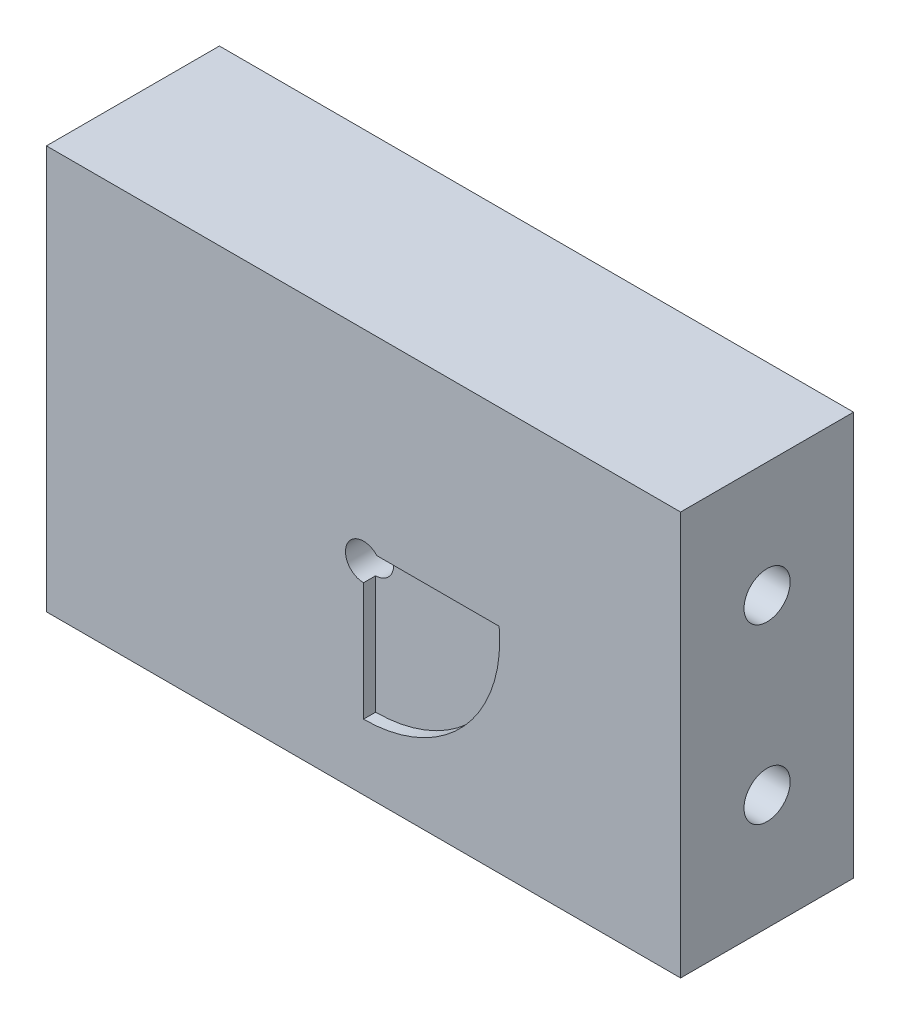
ISO-10303-21;
HEADER;
FILE_DESCRIPTION(('STEP AP214'),'2;1');
FILE_NAME('part.step','',(''),(''),'','','');
FILE_SCHEMA(('AUTOMOTIVE_DESIGN { 1 0 10303 214 1 1 1 1 }'));
ENDSEC;
DATA;
#1=APPLICATION_CONTEXT('core data for automotive mechanical design processes');
#2=APPLICATION_PROTOCOL_DEFINITION('international standard','automotive_design',2000,#1);
#3=PRODUCT_CONTEXT('',#1,'mechanical');
#4=PRODUCT('Part','Part','',(#3));
#5=PRODUCT_RELATED_PRODUCT_CATEGORY('part','',(#4));
#6=PRODUCT_DEFINITION_FORMATION('','',#4);
#7=PRODUCT_DEFINITION_CONTEXT('part definition',#1,'design');
#8=PRODUCT_DEFINITION('design','',#6,#7);
#9=PRODUCT_DEFINITION_SHAPE('','',#8);
#10=(LENGTH_UNIT() NAMED_UNIT(*) SI_UNIT(.MILLI.,.METRE.));
#11=(NAMED_UNIT(*) PLANE_ANGLE_UNIT() SI_UNIT($,.RADIAN.));
#12=(NAMED_UNIT(*) SI_UNIT($,.STERADIAN.) SOLID_ANGLE_UNIT());
#13=UNCERTAINTY_MEASURE_WITH_UNIT(LENGTH_MEASURE(1.E-05),#10,'distance_accuracy_value','');
#14=(GEOMETRIC_REPRESENTATION_CONTEXT(3) GLOBAL_UNCERTAINTY_ASSIGNED_CONTEXT((#13)) GLOBAL_UNIT_ASSIGNED_CONTEXT((#10,
#11,#12)) REPRESENTATION_CONTEXT('',''));
#15=CARTESIAN_POINT('',(0.,0.,0.));
#16=DIRECTION('',(0.,0.,1.));
#17=DIRECTION('',(1.,0.,0.));
#18=AXIS2_PLACEMENT_3D('',#15,#16,#17);
#19=CARTESIAN_POINT('',(0.360795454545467,0.,-6.35));
#20=DIRECTION('',(0.,0.,1.));
#21=DIRECTION('',(1.,0.,0.));
#22=AXIS2_PLACEMENT_3D('',#19,#20,#21);
#23=PLANE('',#22);
#24=CARTESIAN_POINT('',(0.,0.,-6.35000000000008));
#25=DIRECTION('',(0.,0.,-1.));
#26=DIRECTION('',(-1.,0.,0.));
#27=AXIS2_PLACEMENT_3D('',#24,#25,#26);
#28=CIRCLE('',#27,3.96875000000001);
#29=CARTESIAN_POINT('',(-3.96875000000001,0.,-6.35000000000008));
#30=VERTEX_POINT('',#29);
#31=EDGE_CURVE('E214',#30,#30,#28,.F.);
#32=ORIENTED_EDGE('',*,*,#31,.T.);
#33=EDGE_LOOP('',(#32));
#34=FACE_BOUND('',#33,.T.);
#35=ADVANCED_FACE('F33',(#34),#23,.T.);
#36=CARTESIAN_POINT('',(-67.31,0.386772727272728,7.62));
#37=DIRECTION('',(1.,0.,0.));
#38=DIRECTION('',(0.,0.,-1.));
#39=AXIS2_PLACEMENT_3D('',#36,#37,#38);
#40=PLANE('',#39);
#41=CARTESIAN_POINT('',(-67.31,0.,7.62));
#42=DIRECTION('',(1.,0.,0.));
#43=DIRECTION('',(0.,0.,-1.));
#44=AXIS2_PLACEMENT_3D('',#41,#42,#43);
#45=CIRCLE('',#44,4.25450000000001);
#46=CARTESIAN_POINT('',(-67.31,0.,3.36549999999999));
#47=VERTEX_POINT('',#46);
#48=EDGE_CURVE('E211',#47,#47,#45,.F.);
#49=ORIENTED_EDGE('',*,*,#48,.T.);
#50=EDGE_LOOP('',(#49));
#51=FACE_BOUND('',#50,.T.);
#52=ADVANCED_FACE('F302',(#51),#40,.F.);
#53=CARTESIAN_POINT('',(-65.278,-9.80209090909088,0.));
#54=DIRECTION('',(1.,0.,0.));
#55=DIRECTION('',(0.,0.,-1.));
#56=AXIS2_PLACEMENT_3D('',#53,#54,#55);
#57=PLANE('',#56);
#58=CARTESIAN_POINT('',(-65.278,-10.16,0.));
#59=DIRECTION('',(1.,0.,0.));
#60=DIRECTION('',(0.,0.,-1.));
#61=AXIS2_PLACEMENT_3D('',#58,#59,#60);
#62=CIRCLE('',#61,3.93700000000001);
#63=CARTESIAN_POINT('',(-65.278,-10.16,-3.93700000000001));
#64=VERTEX_POINT('',#63);
#65=EDGE_CURVE('E208',#64,#64,#62,.F.);
#66=ORIENTED_EDGE('',*,*,#65,.T.);
#67=EDGE_LOOP('',(#66));
#68=FACE_BOUND('',#67,.T.);
#69=ADVANCED_FACE('F307',(#68),#57,.F.);
#70=CARTESIAN_POINT('',(-65.278,10.5179090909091,0.));
#71=DIRECTION('',(1.,0.,0.));
#72=DIRECTION('',(0.,0.,-1.));
#73=AXIS2_PLACEMENT_3D('',#70,#71,#72);
#74=PLANE('',#73);
#75=CARTESIAN_POINT('',(-65.278,10.16,0.));
#76=DIRECTION('',(1.,0.,0.));
#77=DIRECTION('',(0.,0.,-1.));
#78=AXIS2_PLACEMENT_3D('',#75,#76,#77);
#79=CIRCLE('',#78,3.93700000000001);
#80=CARTESIAN_POINT('',(-65.278,10.16,-3.93700000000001));
#81=VERTEX_POINT('',#80);
#82=EDGE_CURVE('E205',#81,#81,#79,.F.);
#83=ORIENTED_EDGE('',*,*,#82,.T.);
#84=EDGE_LOOP('',(#83));
#85=FACE_BOUND('',#84,.T.);
#86=ADVANCED_FACE('F691',(#85),#74,.F.);
#87=CARTESIAN_POINT('',(-67.31,0.386772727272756,-7.62));
#88=DIRECTION('',(1.,0.,0.));
#89=DIRECTION('',(0.,0.,-1.));
#90=AXIS2_PLACEMENT_3D('',#87,#88,#89);
#91=PLANE('',#90);
#92=CARTESIAN_POINT('',(-67.31,0.,-7.62));
#93=DIRECTION('',(1.,0.,0.));
#94=DIRECTION('',(0.,0.,-1.));
#95=AXIS2_PLACEMENT_3D('',#92,#93,#94);
#96=CIRCLE('',#95,4.25450000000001);
#97=CARTESIAN_POINT('',(-67.31,0.,-11.8745));
#98=VERTEX_POINT('',#97);
#99=EDGE_CURVE('E202',#98,#98,#96,.F.);
#100=ORIENTED_EDGE('',*,*,#99,.T.);
#101=EDGE_LOOP('',(#100));
#102=FACE_BOUND('',#101,.T.);
#103=ADVANCED_FACE('F682',(#102),#91,.F.);
#104=CARTESIAN_POINT('',(-67.31,-39.3007272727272,5.08000000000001));
#105=DIRECTION('',(1.,0.,0.));
#106=DIRECTION('',(0.,0.,-1.));
#107=AXIS2_PLACEMENT_3D('',#104,#105,#106);
#108=PLANE('',#107);
#109=CARTESIAN_POINT('',(-67.31,-39.6875,5.08000000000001));
#110=DIRECTION('',(1.,0.,0.));
#111=DIRECTION('',(0.,0.,-1.));
#112=AXIS2_PLACEMENT_3D('',#109,#110,#111);
#113=CIRCLE('',#112,4.25450000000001);
#114=CARTESIAN_POINT('',(-67.31,-39.6875,0.825500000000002));
#115=VERTEX_POINT('',#114);
#116=EDGE_CURVE('E199',#115,#115,#113,.F.);
#117=ORIENTED_EDGE('',*,*,#116,.T.);
#118=EDGE_LOOP('',(#117));
#119=FACE_BOUND('',#118,.T.);
#120=ADVANCED_FACE('F582',(#119),#108,.F.);
#121=CARTESIAN_POINT('',(-67.31,40.0742727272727,5.08000000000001));
#122=DIRECTION('',(1.,0.,0.));
#123=DIRECTION('',(0.,0.,-1.));
#124=AXIS2_PLACEMENT_3D('',#121,#122,#123);
#125=PLANE('',#124);
#126=CARTESIAN_POINT('',(-67.31,39.6875,5.08000000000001));
#127=DIRECTION('',(1.,0.,0.));
#128=DIRECTION('',(0.,0.,-1.));
#129=AXIS2_PLACEMENT_3D('',#126,#127,#128);
#130=CIRCLE('',#129,4.25450000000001);
#131=CARTESIAN_POINT('',(-67.31,39.6875,0.825500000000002));
#132=VERTEX_POINT('',#131);
#133=EDGE_CURVE('E196',#132,#132,#130,.F.);
#134=ORIENTED_EDGE('',*,*,#133,.T.);
#135=EDGE_LOOP('',(#134));
#136=FACE_BOUND('',#135,.T.);
#137=ADVANCED_FACE('F564',(#136),#125,.F.);
#138=CARTESIAN_POINT('',(-67.31,40.0742727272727,-5.08));
#139=DIRECTION('',(1.,0.,0.));
#140=DIRECTION('',(0.,0.,-1.));
#141=AXIS2_PLACEMENT_3D('',#138,#139,#140);
#142=PLANE('',#141);
#143=CARTESIAN_POINT('',(-67.31,39.6875,-5.08));
#144=DIRECTION('',(1.,0.,0.));
#145=DIRECTION('',(0.,0.,-1.));
#146=AXIS2_PLACEMENT_3D('',#143,#144,#145);
#147=CIRCLE('',#146,4.25450000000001);
#148=CARTESIAN_POINT('',(-67.31,39.6875,-9.33450000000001));
#149=VERTEX_POINT('',#148);
#150=EDGE_CURVE('E193',#149,#149,#147,.F.);
#151=ORIENTED_EDGE('',*,*,#150,.T.);
#152=EDGE_LOOP('',(#151));
#153=FACE_BOUND('',#152,.T.);
#154=ADVANCED_FACE('F559',(#153),#142,.F.);
#155=CARTESIAN_POINT('',(-67.31,-39.3007272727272,-5.08));
#156=DIRECTION('',(1.,0.,0.));
#157=DIRECTION('',(0.,0.,-1.));
#158=AXIS2_PLACEMENT_3D('',#155,#156,#157);
#159=PLANE('',#158);
#160=CARTESIAN_POINT('',(-67.31,-39.6875,-5.08));
#161=DIRECTION('',(1.,0.,0.));
#162=DIRECTION('',(0.,0.,-1.));
#163=AXIS2_PLACEMENT_3D('',#160,#161,#162);
#164=CIRCLE('',#163,4.25450000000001);
#165=CARTESIAN_POINT('',(-67.31,-39.6875,-9.33450000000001));
#166=VERTEX_POINT('',#165);
#167=EDGE_CURVE('E190',#166,#166,#164,.F.);
#168=ORIENTED_EDGE('',*,*,#167,.T.);
#169=EDGE_LOOP('',(#168));
#170=FACE_BOUND('',#169,.T.);
#171=ADVANCED_FACE('F330',(#170),#159,.F.);
#172=CARTESIAN_POINT('',(-66.802,-27.94,5.1816));
#173=DIRECTION('',(1.,0.,0.));
#174=DIRECTION('',(0.,0.,-1.));
#175=AXIS2_PLACEMENT_3D('',#172,#173,#174);
#176=PLANE('',#175);
#177=CARTESIAN_POINT('',(-66.802,-22.86,0.));
#178=DIRECTION('',(1.,0.,0.));
#179=DIRECTION('',(0.,0.,-1.));
#180=AXIS2_PLACEMENT_3D('',#177,#178,#179);
#181=CIRCLE('',#180,5.08);
#182=CARTESIAN_POINT('',(-66.802,-22.86,-5.08));
#183=VERTEX_POINT('',#182);
#184=EDGE_CURVE('E187',#183,#183,#181,.F.);
#185=ORIENTED_EDGE('',*,*,#184,.T.);
#186=EDGE_LOOP('',(#185));
#187=FACE_BOUND('',#186,.T.);
#188=ADVANCED_FACE('F327',(#187),#176,.F.);
#189=CARTESIAN_POINT('',(-66.802,23.3218181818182,0.));
#190=DIRECTION('',(1.,0.,0.));
#191=DIRECTION('',(0.,0.,-1.));
#192=AXIS2_PLACEMENT_3D('',#189,#190,#191);
#193=PLANE('',#192);
#194=CARTESIAN_POINT('',(-66.802,22.86,0.));
#195=DIRECTION('',(1.,0.,0.));
#196=DIRECTION('',(0.,0.,-1.));
#197=AXIS2_PLACEMENT_3D('',#194,#195,#196);
#198=CIRCLE('',#197,5.08);
#199=CARTESIAN_POINT('',(-66.802,22.86,-5.08));
#200=VERTEX_POINT('',#199);
#201=EDGE_CURVE('E184',#200,#200,#198,.F.);
#202=ORIENTED_EDGE('',*,*,#201,.T.);
#203=EDGE_LOOP('',(#202));
#204=FACE_BOUND('',#203,.T.);
#205=ADVANCED_FACE('F297',(#204),#193,.F.);
#206=CARTESIAN_POINT('',(0.,0.,19.05));
#207=DIRECTION('',(0.,0.,-1.));
#208=DIRECTION('',(-1.,0.,0.));
#209=AXIS2_PLACEMENT_3D('',#206,#207,#208);
#210=CYLINDRICAL_SURFACE('',#209,3.96875000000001);
#211=CARTESIAN_POINT('',(0.,0.,19.05));
#212=DIRECTION('',(0.,0.,-1.));
#213=DIRECTION('',(-1.,0.,0.));
#214=AXIS2_PLACEMENT_3D('',#211,#212,#213);
#215=CIRCLE('',#214,3.96875000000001);
#216=CARTESIAN_POINT('',(0.,-3.96875000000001,19.05));
#217=VERTEX_POINT('',#216);
#218=CARTESIAN_POINT('',(2.93906236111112,2.667,19.05));
#219=VERTEX_POINT('',#218);
#220=EDGE_CURVE('E181',#217,#219,#215,.T.);
#221=ORIENTED_EDGE('',*,*,#220,.F.);
#222=DIRECTION('',(0.,0.,-1.));
#223=VECTOR('',#222,1.);
#224=CARTESIAN_POINT('',(0.,-3.96875000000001,19.05));
#225=LINE('',#224,#223);
#226=CARTESIAN_POINT('',(0.,-3.96875000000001,16.383));
#227=VERTEX_POINT('',#226);
#228=EDGE_CURVE('E216',#217,#227,#225,.T.);
#229=ORIENTED_EDGE('',*,*,#228,.T.);
#230=CARTESIAN_POINT('',(0.,0.,16.383));
#231=DIRECTION('',(0.,0.,1.));
#232=DIRECTION('',(1.,0.,0.));
#233=AXIS2_PLACEMENT_3D('',#230,#231,#232);
#234=CIRCLE('',#233,3.96875000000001);
#235=CARTESIAN_POINT('',(2.93906236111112,2.667,16.383));
#236=VERTEX_POINT('',#235);
#237=EDGE_CURVE('E11',#236,#227,#234,.F.);
#238=ORIENTED_EDGE('',*,*,#237,.F.);
#239=DIRECTION('',(0.,0.,-1.));
#240=VECTOR('',#239,1.);
#241=CARTESIAN_POINT('',(2.93906236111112,2.667,19.05));
#242=LINE('',#241,#240);
#243=EDGE_CURVE('E237',#236,#219,#242,.F.);
#244=ORIENTED_EDGE('',*,*,#243,.T.);
#245=EDGE_LOOP('',(#221,#229,#238,#244));
#246=FACE_BOUND('',#245,.T.);
#247=ORIENTED_EDGE('',*,*,#31,.F.);
#248=EDGE_LOOP('',(#247));
#249=FACE_BOUND('',#248,.T.);
#250=ADVANCED_FACE('F293',(#246,#249),#210,.F.);
#251=CARTESIAN_POINT('',(39.116,13.97,5.1816));
#252=DIRECTION('',(1.,0.,0.));
#253=DIRECTION('',(0.,0.,-1.));
#254=AXIS2_PLACEMENT_3D('',#251,#252,#253);
#255=PLANE('',#254);
#256=CARTESIAN_POINT('',(39.116,19.05,0.));
#257=DIRECTION('',(-1.,0.,0.));
#258=DIRECTION('',(0.,0.,1.));
#259=AXIS2_PLACEMENT_3D('',#256,#257,#258);
#260=CIRCLE('',#259,5.08);
#261=CARTESIAN_POINT('',(39.116,19.05,5.08));
#262=VERTEX_POINT('',#261);
#263=EDGE_CURVE('E178',#262,#262,#260,.F.);
#264=ORIENTED_EDGE('',*,*,#263,.T.);
#265=EDGE_LOOP('',(#264));
#266=FACE_BOUND('',#265,.T.);
#267=ADVANCED_FACE('F296',(#266),#255,.T.);
#268=CARTESIAN_POINT('',(39.116,-18.5881818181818,0.));
#269=DIRECTION('',(1.,0.,0.));
#270=DIRECTION('',(0.,0.,-1.));
#271=AXIS2_PLACEMENT_3D('',#268,#269,#270);
#272=PLANE('',#271);
#273=CARTESIAN_POINT('',(39.116,-19.05,0.));
#274=DIRECTION('',(-1.,0.,0.));
#275=DIRECTION('',(0.,0.,1.));
#276=AXIS2_PLACEMENT_3D('',#273,#274,#275);
#277=CIRCLE('',#276,5.08);
#278=CARTESIAN_POINT('',(39.116,-19.05,5.08));
#279=VERTEX_POINT('',#278);
#280=EDGE_CURVE('E174',#279,#279,#277,.F.);
#281=ORIENTED_EDGE('',*,*,#280,.T.);
#282=EDGE_LOOP('',(#281));
#283=FACE_BOUND('',#282,.T.);
#284=ADVANCED_FACE('F333',(#283),#272,.T.);
#285=CARTESIAN_POINT('',(-69.85,0.,7.62));
#286=DIRECTION('',(1.,0.,0.));
#287=DIRECTION('',(0.,0.,-1.));
#288=AXIS2_PLACEMENT_3D('',#285,#286,#287);
#289=CYLINDRICAL_SURFACE('',#288,4.25450000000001);
#290=CARTESIAN_POINT('',(-69.85,0.,7.62));
#291=DIRECTION('',(1.,0.,0.));
#292=DIRECTION('',(0.,0.,-1.));
#293=AXIS2_PLACEMENT_3D('',#290,#291,#292);
#294=CIRCLE('',#293,4.25450000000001);
#295=CARTESIAN_POINT('',(-69.85,0.,3.36549999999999));
#296=VERTEX_POINT('',#295);
#297=EDGE_CURVE('E85',#296,#296,#294,.T.);
#298=ORIENTED_EDGE('',*,*,#297,.F.);
#299=EDGE_LOOP('',(#298));
#300=FACE_BOUND('',#299,.T.);
#301=ORIENTED_EDGE('',*,*,#48,.F.);
#302=EDGE_LOOP('',(#301));
#303=FACE_BOUND('',#302,.T.);
#304=ADVANCED_FACE('F373',(#300,#303),#289,.F.);
#305=CARTESIAN_POINT('',(-69.85,-10.16,0.));
#306=DIRECTION('',(1.,0.,0.));
#307=DIRECTION('',(0.,0.,-1.));
#308=AXIS2_PLACEMENT_3D('',#305,#306,#307);
#309=CYLINDRICAL_SURFACE('',#308,3.93700000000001);
#310=CARTESIAN_POINT('',(-69.85,-10.16,0.));
#311=DIRECTION('',(1.,0.,0.));
#312=DIRECTION('',(0.,0.,-1.));
#313=AXIS2_PLACEMENT_3D('',#310,#311,#312);
#314=CIRCLE('',#313,3.93700000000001);
#315=CARTESIAN_POINT('',(-69.85,-10.16,-3.93700000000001));
#316=VERTEX_POINT('',#315);
#317=EDGE_CURVE('E169',#316,#316,#314,.T.);
#318=ORIENTED_EDGE('',*,*,#317,.F.);
#319=EDGE_LOOP('',(#318));
#320=FACE_BOUND('',#319,.T.);
#321=ORIENTED_EDGE('',*,*,#65,.F.);
#322=EDGE_LOOP('',(#321));
#323=FACE_BOUND('',#322,.T.);
#324=ADVANCED_FACE('F376',(#320,#323),#309,.F.);
#325=CARTESIAN_POINT('',(-69.85,10.16,0.));
#326=DIRECTION('',(1.,0.,0.));
#327=DIRECTION('',(0.,0.,-1.));
#328=AXIS2_PLACEMENT_3D('',#325,#326,#327);
#329=CYLINDRICAL_SURFACE('',#328,3.93700000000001);
#330=CARTESIAN_POINT('',(-69.85,10.16,0.));
#331=DIRECTION('',(1.,0.,0.));
#332=DIRECTION('',(0.,0.,-1.));
#333=AXIS2_PLACEMENT_3D('',#330,#331,#332);
#334=CIRCLE('',#333,3.93700000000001);
#335=CARTESIAN_POINT('',(-69.85,10.16,-3.93700000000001));
#336=VERTEX_POINT('',#335);
#337=EDGE_CURVE('E166',#336,#336,#334,.T.);
#338=ORIENTED_EDGE('',*,*,#337,.F.);
#339=EDGE_LOOP('',(#338));
#340=FACE_BOUND('',#339,.T.);
#341=ORIENTED_EDGE('',*,*,#82,.F.);
#342=EDGE_LOOP('',(#341));
#343=FACE_BOUND('',#342,.T.);
#344=ADVANCED_FACE('F383',(#340,#343),#329,.F.);
#345=CARTESIAN_POINT('',(-69.85,0.,-7.62));
#346=DIRECTION('',(1.,0.,0.));
#347=DIRECTION('',(0.,0.,-1.));
#348=AXIS2_PLACEMENT_3D('',#345,#346,#347);
#349=CYLINDRICAL_SURFACE('',#348,4.25450000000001);
#350=CARTESIAN_POINT('',(-69.85,0.,-7.62));
#351=DIRECTION('',(1.,0.,0.));
#352=DIRECTION('',(0.,0.,-1.));
#353=AXIS2_PLACEMENT_3D('',#350,#351,#352);
#354=CIRCLE('',#353,4.25450000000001);
#355=CARTESIAN_POINT('',(-69.85,0.,-11.8745));
#356=VERTEX_POINT('',#355);
#357=EDGE_CURVE('E163',#356,#356,#354,.T.);
#358=ORIENTED_EDGE('',*,*,#357,.F.);
#359=EDGE_LOOP('',(#358));
#360=FACE_BOUND('',#359,.T.);
#361=ORIENTED_EDGE('',*,*,#99,.F.);
#362=EDGE_LOOP('',(#361));
#363=FACE_BOUND('',#362,.T.);
#364=ADVANCED_FACE('F391',(#360,#363),#349,.F.);
#365=CARTESIAN_POINT('',(-69.85,-39.6875,5.08000000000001));
#366=DIRECTION('',(1.,0.,0.));
#367=DIRECTION('',(0.,0.,-1.));
#368=AXIS2_PLACEMENT_3D('',#365,#366,#367);
#369=CYLINDRICAL_SURFACE('',#368,4.25450000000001);
#370=CARTESIAN_POINT('',(-69.85,-39.6875,5.08000000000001));
#371=DIRECTION('',(1.,0.,0.));
#372=DIRECTION('',(0.,0.,-1.));
#373=AXIS2_PLACEMENT_3D('',#370,#371,#372);
#374=CIRCLE('',#373,4.25450000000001);
#375=CARTESIAN_POINT('',(-69.85,-39.6875,0.825500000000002));
#376=VERTEX_POINT('',#375);
#377=EDGE_CURVE('E160',#376,#376,#374,.T.);
#378=ORIENTED_EDGE('',*,*,#377,.F.);
#379=EDGE_LOOP('',(#378));
#380=FACE_BOUND('',#379,.T.);
#381=ORIENTED_EDGE('',*,*,#116,.F.);
#382=EDGE_LOOP('',(#381));
#383=FACE_BOUND('',#382,.T.);
#384=ADVANCED_FACE('F395',(#380,#383),#369,.F.);
#385=CARTESIAN_POINT('',(-69.85,39.6875,5.08000000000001));
#386=DIRECTION('',(1.,0.,0.));
#387=DIRECTION('',(0.,0.,-1.));
#388=AXIS2_PLACEMENT_3D('',#385,#386,#387);
#389=CYLINDRICAL_SURFACE('',#388,4.25450000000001);
#390=CARTESIAN_POINT('',(-69.85,39.6875,5.08000000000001));
#391=DIRECTION('',(1.,0.,0.));
#392=DIRECTION('',(0.,0.,-1.));
#393=AXIS2_PLACEMENT_3D('',#390,#391,#392);
#394=CIRCLE('',#393,4.25450000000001);
#395=CARTESIAN_POINT('',(-69.85,39.6875,0.825500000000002));
#396=VERTEX_POINT('',#395);
#397=EDGE_CURVE('E157',#396,#396,#394,.T.);
#398=ORIENTED_EDGE('',*,*,#397,.F.);
#399=EDGE_LOOP('',(#398));
#400=FACE_BOUND('',#399,.T.);
#401=ORIENTED_EDGE('',*,*,#133,.F.);
#402=EDGE_LOOP('',(#401));
#403=FACE_BOUND('',#402,.T.);
#404=ADVANCED_FACE('F399',(#400,#403),#389,.F.);
#405=CARTESIAN_POINT('',(-69.85,39.6875,-5.08));
#406=DIRECTION('',(1.,0.,0.));
#407=DIRECTION('',(0.,0.,-1.));
#408=AXIS2_PLACEMENT_3D('',#405,#406,#407);
#409=CYLINDRICAL_SURFACE('',#408,4.25450000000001);
#410=CARTESIAN_POINT('',(-69.85,39.6875,-5.08));
#411=DIRECTION('',(1.,0.,0.));
#412=DIRECTION('',(0.,0.,-1.));
#413=AXIS2_PLACEMENT_3D('',#410,#411,#412);
#414=CIRCLE('',#413,4.25450000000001);
#415=CARTESIAN_POINT('',(-69.85,39.6875,-9.33450000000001));
#416=VERTEX_POINT('',#415);
#417=EDGE_CURVE('E154',#416,#416,#414,.T.);
#418=ORIENTED_EDGE('',*,*,#417,.F.);
#419=EDGE_LOOP('',(#418));
#420=FACE_BOUND('',#419,.T.);
#421=ORIENTED_EDGE('',*,*,#150,.F.);
#422=EDGE_LOOP('',(#421));
#423=FACE_BOUND('',#422,.T.);
#424=ADVANCED_FACE('F346',(#420,#423),#409,.F.);
#425=CARTESIAN_POINT('',(-69.85,-39.6875,-5.08));
#426=DIRECTION('',(1.,0.,0.));
#427=DIRECTION('',(0.,0.,-1.));
#428=AXIS2_PLACEMENT_3D('',#425,#426,#427);
#429=CYLINDRICAL_SURFACE('',#428,4.25450000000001);
#430=CARTESIAN_POINT('',(-69.85,-39.6875,-5.08));
#431=DIRECTION('',(1.,0.,0.));
#432=DIRECTION('',(0.,0.,-1.));
#433=AXIS2_PLACEMENT_3D('',#430,#431,#432);
#434=CIRCLE('',#433,4.25450000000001);
#435=CARTESIAN_POINT('',(-69.85,-39.6875,-9.33450000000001));
#436=VERTEX_POINT('',#435);
#437=EDGE_CURVE('E151',#436,#436,#434,.T.);
#438=ORIENTED_EDGE('',*,*,#437,.F.);
#439=EDGE_LOOP('',(#438));
#440=FACE_BOUND('',#439,.T.);
#441=ORIENTED_EDGE('',*,*,#167,.F.);
#442=EDGE_LOOP('',(#441));
#443=FACE_BOUND('',#442,.T.);
#444=ADVANCED_FACE('F338',(#440,#443),#429,.F.);
#445=CARTESIAN_POINT('',(-69.85,-22.86,0.));
#446=DIRECTION('',(1.,0.,0.));
#447=DIRECTION('',(0.,0.,-1.));
#448=AXIS2_PLACEMENT_3D('',#445,#446,#447);
#449=CYLINDRICAL_SURFACE('',#448,5.08);
#450=ORIENTED_EDGE('',*,*,#184,.F.);
#451=EDGE_LOOP('',(#450));
#452=FACE_BOUND('',#451,.T.);
#453=CARTESIAN_POINT('',(-69.85,-22.86,0.));
#454=DIRECTION('',(1.,0.,0.));
#455=DIRECTION('',(0.,0.,-1.));
#456=AXIS2_PLACEMENT_3D('',#453,#454,#455);
#457=CIRCLE('',#456,5.08);
#458=CARTESIAN_POINT('',(-69.85,-22.86,-5.08));
#459=VERTEX_POINT('',#458);
#460=EDGE_CURVE('E148',#459,#459,#457,.T.);
#461=ORIENTED_EDGE('',*,*,#460,.F.);
#462=EDGE_LOOP('',(#461));
#463=FACE_BOUND('',#462,.T.);
#464=ADVANCED_FACE('F335',(#452,#463),#449,.F.);
#465=CARTESIAN_POINT('',(-69.85,22.86,0.));
#466=DIRECTION('',(1.,0.,0.));
#467=DIRECTION('',(0.,0.,-1.));
#468=AXIS2_PLACEMENT_3D('',#465,#466,#467);
#469=CYLINDRICAL_SURFACE('',#468,5.08);
#470=ORIENTED_EDGE('',*,*,#201,.F.);
#471=EDGE_LOOP('',(#470));
#472=FACE_BOUND('',#471,.T.);
#473=CARTESIAN_POINT('',(-69.85,22.86,0.));
#474=DIRECTION('',(1.,0.,0.));
#475=DIRECTION('',(0.,0.,-1.));
#476=AXIS2_PLACEMENT_3D('',#473,#474,#475);
#477=CIRCLE('',#476,5.08);
#478=CARTESIAN_POINT('',(-69.85,22.86,-5.08));
#479=VERTEX_POINT('',#478);
#480=EDGE_CURVE('E144',#479,#479,#477,.T.);
#481=ORIENTED_EDGE('',*,*,#480,.F.);
#482=EDGE_LOOP('',(#481));
#483=FACE_BOUND('',#482,.T.);
#484=ADVANCED_FACE('F337',(#472,#483),#469,.F.);
#485=CARTESIAN_POINT('',(0.,0.,19.05));
#486=DIRECTION('',(0.,0.,1.));
#487=DIRECTION('',(1.,0.,0.));
#488=AXIS2_PLACEMENT_3D('',#485,#486,#487);
#489=PLANE('',#488);
#490=DIRECTION('',(0.,-1.,0.));
#491=VECTOR('',#490,1.);
#492=CARTESIAN_POINT('',(0.,0.,19.05));
#493=LINE('',#492,#491);
#494=CARTESIAN_POINT('',(0.,-30.,19.05));
#495=VERTEX_POINT('',#494);
#496=EDGE_CURVE('E41',#217,#495,#493,.T.);
#497=ORIENTED_EDGE('',*,*,#496,.F.);
#498=ORIENTED_EDGE('',*,*,#220,.T.);
#499=DIRECTION('',(-1.,0.,0.));
#500=VECTOR('',#499,1.);
#501=CARTESIAN_POINT('',(0.,2.667,19.05));
#502=LINE('',#501,#500);
#503=CARTESIAN_POINT('',(29.8812166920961,2.667,19.05));
#504=VERTEX_POINT('',#503);
#505=EDGE_CURVE('E244',#504,#219,#502,.T.);
#506=ORIENTED_EDGE('',*,*,#505,.F.);
#507=CARTESIAN_POINT('',(0.,0.,19.05));
#508=DIRECTION('',(0.,0.,1.));
#509=DIRECTION('',(1.,0.,0.));
#510=AXIS2_PLACEMENT_3D('',#507,#508,#509);
#511=CIRCLE('',#510,30.);
#512=EDGE_CURVE('E48',#495,#504,#511,.T.);
#513=ORIENTED_EDGE('',*,*,#512,.F.);
#514=EDGE_LOOP('',(#497,#498,#506,#513));
#515=FACE_BOUND('',#514,.T.);
#516=DIRECTION('',(0.,1.,0.));
#517=VECTOR('',#516,1.);
#518=CARTESIAN_POINT('',(69.85,44.45,19.05));
#519=LINE('',#518,#517);
#520=CARTESIAN_POINT('',(69.85,44.45,19.05));
#521=VERTEX_POINT('',#520);
#522=CARTESIAN_POINT('',(69.85,-44.45,19.05));
#523=VERTEX_POINT('',#522);
#524=EDGE_CURVE('E259',#521,#523,#519,.F.);
#525=ORIENTED_EDGE('',*,*,#524,.F.);
#526=DIRECTION('',(1.,0.,0.));
#527=VECTOR('',#526,1.);
#528=CARTESIAN_POINT('',(-69.85,44.45,19.05));
#529=LINE('',#528,#527);
#530=CARTESIAN_POINT('',(-69.85,44.45,19.05));
#531=VERTEX_POINT('',#530);
#532=EDGE_CURVE('E177',#531,#521,#529,.T.);
#533=ORIENTED_EDGE('',*,*,#532,.F.);
#534=DIRECTION('',(0.,1.,0.));
#535=VECTOR('',#534,1.);
#536=CARTESIAN_POINT('',(-69.85,-44.45,19.05));
#537=LINE('',#536,#535);
#538=CARTESIAN_POINT('',(-69.85,-44.45,19.05));
#539=VERTEX_POINT('',#538);
#540=EDGE_CURVE('E80',#539,#531,#537,.T.);
#541=ORIENTED_EDGE('',*,*,#540,.F.);
#542=DIRECTION('',(1.,0.,0.));
#543=VECTOR('',#542,1.);
#544=CARTESIAN_POINT('',(69.85,-44.45,19.05));
#545=LINE('',#544,#543);
#546=EDGE_CURVE('E147',#523,#539,#545,.F.);
#547=ORIENTED_EDGE('',*,*,#546,.F.);
#548=EDGE_LOOP('',(#525,#533,#541,#547));
#549=FACE_BOUND('',#548,.T.);
#550=ADVANCED_FACE('F241',(#515,#549),#489,.T.);
#551=CARTESIAN_POINT('',(69.85,19.05,0.));
#552=DIRECTION('',(-1.,0.,0.));
#553=DIRECTION('',(0.,0.,1.));
#554=AXIS2_PLACEMENT_3D('',#551,#552,#553);
#555=CYLINDRICAL_SURFACE('',#554,5.08);
#556=ORIENTED_EDGE('',*,*,#263,.F.);
#557=EDGE_LOOP('',(#556));
#558=FACE_BOUND('',#557,.T.);
#559=CARTESIAN_POINT('',(69.85,19.05,0.));
#560=DIRECTION('',(-1.,0.,0.));
#561=DIRECTION('',(0.,0.,1.));
#562=AXIS2_PLACEMENT_3D('',#559,#560,#561);
#563=CIRCLE('',#562,5.08);
#564=CARTESIAN_POINT('',(69.85,19.05,5.08));
#565=VERTEX_POINT('',#564);
#566=EDGE_CURVE('E141',#565,#565,#563,.T.);
#567=ORIENTED_EDGE('',*,*,#566,.F.);
#568=EDGE_LOOP('',(#567));
#569=FACE_BOUND('',#568,.T.);
#570=ADVANCED_FACE('F35',(#558,#569),#555,.F.);
#571=CARTESIAN_POINT('',(69.85,-19.05,0.));
#572=DIRECTION('',(-1.,0.,0.));
#573=DIRECTION('',(0.,0.,1.));
#574=AXIS2_PLACEMENT_3D('',#571,#572,#573);
#575=CYLINDRICAL_SURFACE('',#574,5.08);
#576=ORIENTED_EDGE('',*,*,#280,.F.);
#577=EDGE_LOOP('',(#576));
#578=FACE_BOUND('',#577,.T.);
#579=CARTESIAN_POINT('',(69.85,-19.05,0.));
#580=DIRECTION('',(-1.,0.,0.));
#581=DIRECTION('',(0.,0.,1.));
#582=AXIS2_PLACEMENT_3D('',#579,#580,#581);
#583=CIRCLE('',#582,5.08);
#584=CARTESIAN_POINT('',(69.85,-19.05,5.08));
#585=VERTEX_POINT('',#584);
#586=EDGE_CURVE('E138',#585,#585,#583,.T.);
#587=ORIENTED_EDGE('',*,*,#586,.F.);
#588=EDGE_LOOP('',(#587));
#589=FACE_BOUND('',#588,.T.);
#590=ADVANCED_FACE('F409',(#578,#589),#575,.F.);
#591=CARTESIAN_POINT('',(-37.7392045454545,38.1,-0.1524));
#592=DIRECTION('',(0.,0.,1.));
#593=DIRECTION('',(1.,0.,0.));
#594=AXIS2_PLACEMENT_3D('',#591,#592,#593);
#595=PLANE('',#594);
#596=CARTESIAN_POINT('',(-38.1,38.1,-0.1524));
#597=DIRECTION('',(0.,0.,-1.));
#598=DIRECTION('',(-1.,0.,0.));
#599=AXIS2_PLACEMENT_3D('',#596,#597,#598);
#600=CIRCLE('',#599,3.96875);
#601=CARTESIAN_POINT('',(-42.06875,38.1,-0.1524));
#602=VERTEX_POINT('',#601);
#603=EDGE_CURVE('E135',#602,#602,#600,.T.);
#604=ORIENTED_EDGE('',*,*,#603,.T.);
#605=EDGE_LOOP('',(#604));
#606=FACE_BOUND('',#605,.T.);
#607=ADVANCED_FACE('F412',(#606),#595,.F.);
#608=CARTESIAN_POINT('',(38.4607954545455,38.1,-0.1524));
#609=DIRECTION('',(0.,0.,1.));
#610=DIRECTION('',(1.,0.,0.));
#611=AXIS2_PLACEMENT_3D('',#608,#609,#610);
#612=PLANE('',#611);
#613=CARTESIAN_POINT('',(38.1,38.1,-0.1524));
#614=DIRECTION('',(0.,0.,-1.));
#615=DIRECTION('',(-1.,0.,0.));
#616=AXIS2_PLACEMENT_3D('',#613,#614,#615);
#617=CIRCLE('',#616,3.96875);
#618=CARTESIAN_POINT('',(34.13125,38.1,-0.1524));
#619=VERTEX_POINT('',#618);
#620=EDGE_CURVE('E132',#619,#619,#617,.T.);
#621=ORIENTED_EDGE('',*,*,#620,.T.);
#622=EDGE_LOOP('',(#621));
#623=FACE_BOUND('',#622,.T.);
#624=ADVANCED_FACE('F416',(#623),#612,.F.);
#625=CARTESIAN_POINT('',(-37.7392045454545,-38.1,-0.1524));
#626=DIRECTION('',(0.,0.,1.));
#627=DIRECTION('',(1.,0.,0.));
#628=AXIS2_PLACEMENT_3D('',#625,#626,#627);
#629=PLANE('',#628);
#630=CARTESIAN_POINT('',(-38.1,-38.1,-0.1524));
#631=DIRECTION('',(0.,0.,-1.));
#632=DIRECTION('',(-1.,0.,0.));
#633=AXIS2_PLACEMENT_3D('',#630,#631,#632);
#634=CIRCLE('',#633,3.96875);
#635=CARTESIAN_POINT('',(-42.06875,-38.1,-0.1524));
#636=VERTEX_POINT('',#635);
#637=EDGE_CURVE('E129',#636,#636,#634,.T.);
#638=ORIENTED_EDGE('',*,*,#637,.T.);
#639=EDGE_LOOP('',(#638));
#640=FACE_BOUND('',#639,.T.);
#641=ADVANCED_FACE('F420',(#640),#629,.F.);
#642=CARTESIAN_POINT('',(0.,0.,-3.5814));
#643=DIRECTION('',(0.,0.,1.));
#644=DIRECTION('',(1.,0.,0.));
#645=AXIS2_PLACEMENT_3D('',#642,#643,#644);
#646=PLANE('',#645);
#647=CARTESIAN_POINT('',(-38.1,0.,-3.5814));
#648=DIRECTION('',(0.,0.,-1.));
#649=DIRECTION('',(-1.,0.,0.));
#650=AXIS2_PLACEMENT_3D('',#647,#648,#649);
#651=CIRCLE('',#650,3.98145);
#652=CARTESIAN_POINT('',(-42.08145,0.,-3.5814));
#653=VERTEX_POINT('',#652);
#654=EDGE_CURVE('E101',#653,#653,#651,.T.);
#655=ORIENTED_EDGE('',*,*,#654,.T.);
#656=EDGE_LOOP('',(#655));
#657=FACE_BOUND('',#656,.T.);
#658=ADVANCED_FACE('F424',(#657),#646,.F.);
#659=CARTESIAN_POINT('',(38.4607954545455,-38.1,-0.1524));
#660=DIRECTION('',(0.,0.,1.));
#661=DIRECTION('',(1.,0.,0.));
#662=AXIS2_PLACEMENT_3D('',#659,#660,#661);
#663=PLANE('',#662);
#664=CARTESIAN_POINT('',(38.1,-38.1,-0.1524));
#665=DIRECTION('',(0.,0.,-1.));
#666=DIRECTION('',(-1.,0.,0.));
#667=AXIS2_PLACEMENT_3D('',#664,#665,#666);
#668=CIRCLE('',#667,3.96875);
#669=CARTESIAN_POINT('',(34.13125,-38.1,-0.1524));
#670=VERTEX_POINT('',#669);
#671=EDGE_CURVE('E98',#670,#670,#668,.T.);
#672=ORIENTED_EDGE('',*,*,#671,.T.);
#673=EDGE_LOOP('',(#672));
#674=FACE_BOUND('',#673,.T.);
#675=ADVANCED_FACE('F428',(#674),#663,.F.);
#676=CARTESIAN_POINT('',(-69.85,44.45,-3.5814));
#677=DIRECTION('',(0.,1.,0.));
#678=DIRECTION('',(0.,0.,1.));
#679=AXIS2_PLACEMENT_3D('',#676,#677,#678);
#680=PLANE('',#679);
#681=DIRECTION('',(1.,0.,0.));
#682=VECTOR('',#681,1.);
#683=CARTESIAN_POINT('',(0.,44.45,-19.05));
#684=LINE('',#683,#682);
#685=CARTESIAN_POINT('',(69.85,44.45,-19.05));
#686=VERTEX_POINT('',#685);
#687=CARTESIAN_POINT('',(-69.85,44.45,-19.05));
#688=VERTEX_POINT('',#687);
#689=EDGE_CURVE('E90',#686,#688,#684,.F.);
#690=ORIENTED_EDGE('',*,*,#689,.T.);
#691=DIRECTION('',(0.,0.,1.));
#692=VECTOR('',#691,1.);
#693=CARTESIAN_POINT('',(-69.85,44.45,-3.5814));
#694=LINE('',#693,#692);
#695=EDGE_CURVE('E73',#531,#688,#694,.F.);
#696=ORIENTED_EDGE('',*,*,#695,.F.);
#697=ORIENTED_EDGE('',*,*,#532,.T.);
#698=DIRECTION('',(0.,0.,-1.));
#699=VECTOR('',#698,1.);
#700=CARTESIAN_POINT('',(69.85,44.45,-3.5814));
#701=LINE('',#700,#699);
#702=EDGE_CURVE('E97',#686,#521,#701,.F.);
#703=ORIENTED_EDGE('',*,*,#702,.F.);
#704=EDGE_LOOP('',(#690,#696,#697,#703));
#705=FACE_BOUND('',#704,.T.);
#706=ADVANCED_FACE('F95',(#705),#680,.T.);
#707=CARTESIAN_POINT('',(-69.85,-44.45,-3.5814));
#708=DIRECTION('',(-1.,0.,0.));
#709=DIRECTION('',(0.,0.,1.));
#710=AXIS2_PLACEMENT_3D('',#707,#708,#709);
#711=PLANE('',#710);
#712=ORIENTED_EDGE('',*,*,#480,.T.);
#713=EDGE_LOOP('',(#712));
#714=FACE_BOUND('',#713,.T.);
#715=ORIENTED_EDGE('',*,*,#460,.T.);
#716=EDGE_LOOP('',(#715));
#717=FACE_BOUND('',#716,.T.);
#718=ORIENTED_EDGE('',*,*,#437,.T.);
#719=EDGE_LOOP('',(#718));
#720=FACE_BOUND('',#719,.T.);
#721=ORIENTED_EDGE('',*,*,#417,.T.);
#722=EDGE_LOOP('',(#721));
#723=FACE_BOUND('',#722,.T.);
#724=ORIENTED_EDGE('',*,*,#397,.T.);
#725=EDGE_LOOP('',(#724));
#726=FACE_BOUND('',#725,.T.);
#727=ORIENTED_EDGE('',*,*,#377,.T.);
#728=EDGE_LOOP('',(#727));
#729=FACE_BOUND('',#728,.T.);
#730=ORIENTED_EDGE('',*,*,#357,.T.);
#731=EDGE_LOOP('',(#730));
#732=FACE_BOUND('',#731,.T.);
#733=ORIENTED_EDGE('',*,*,#337,.T.);
#734=EDGE_LOOP('',(#733));
#735=FACE_BOUND('',#734,.T.);
#736=ORIENTED_EDGE('',*,*,#317,.T.);
#737=EDGE_LOOP('',(#736));
#738=FACE_BOUND('',#737,.T.);
#739=ORIENTED_EDGE('',*,*,#297,.T.);
#740=EDGE_LOOP('',(#739));
#741=FACE_BOUND('',#740,.T.);
#742=DIRECTION('',(0.,1.,0.));
#743=VECTOR('',#742,1.);
#744=CARTESIAN_POINT('',(-69.85,0.,-19.05));
#745=LINE('',#744,#743);
#746=CARTESIAN_POINT('',(-69.85,-44.45,-19.05));
#747=VERTEX_POINT('',#746);
#748=EDGE_CURVE('E77',#688,#747,#745,.F.);
#749=ORIENTED_EDGE('',*,*,#748,.T.);
#750=DIRECTION('',(0.,0.,-1.));
#751=VECTOR('',#750,1.);
#752=CARTESIAN_POINT('',(-69.85,-44.45,-3.5814));
#753=LINE('',#752,#751);
#754=EDGE_CURVE('E257',#539,#747,#753,.T.);
#755=ORIENTED_EDGE('',*,*,#754,.F.);
#756=ORIENTED_EDGE('',*,*,#540,.T.);
#757=ORIENTED_EDGE('',*,*,#695,.T.);
#758=EDGE_LOOP('',(#749,#755,#756,#757));
#759=FACE_BOUND('',#758,.T.);
#760=ADVANCED_FACE('F75',(#714,#717,#720,#723,#726,#729,#732,#735,#738,#741,#759),#711,.T.);
#761=CARTESIAN_POINT('',(69.85,-44.45,-3.5814));
#762=DIRECTION('',(0.,-1.,0.));
#763=DIRECTION('',(0.,0.,-1.));
#764=AXIS2_PLACEMENT_3D('',#761,#762,#763);
#765=PLANE('',#764);
#766=DIRECTION('',(1.,0.,0.));
#767=VECTOR('',#766,1.);
#768=CARTESIAN_POINT('',(0.,-44.45,-19.05));
#769=LINE('',#768,#767);
#770=CARTESIAN_POINT('',(69.85,-44.45,-19.05));
#771=VERTEX_POINT('',#770);
#772=EDGE_CURVE('E93',#747,#771,#769,.T.);
#773=ORIENTED_EDGE('',*,*,#772,.T.);
#774=DIRECTION('',(0.,0.,-1.));
#775=VECTOR('',#774,1.);
#776=CARTESIAN_POINT('',(69.85,-44.45,-3.5814));
#777=LINE('',#776,#775);
#778=EDGE_CURVE('E57',#523,#771,#777,.T.);
#779=ORIENTED_EDGE('',*,*,#778,.F.);
#780=ORIENTED_EDGE('',*,*,#546,.T.);
#781=ORIENTED_EDGE('',*,*,#754,.T.);
#782=EDGE_LOOP('',(#773,#779,#780,#781));
#783=FACE_BOUND('',#782,.T.);
#784=ADVANCED_FACE('F266',(#783),#765,.T.);
#785=CARTESIAN_POINT('',(69.85,44.45,-3.5814));
#786=DIRECTION('',(1.,0.,0.));
#787=DIRECTION('',(0.,0.,-1.));
#788=AXIS2_PLACEMENT_3D('',#785,#786,#787);
#789=PLANE('',#788);
#790=ORIENTED_EDGE('',*,*,#586,.T.);
#791=EDGE_LOOP('',(#790));
#792=FACE_BOUND('',#791,.T.);
#793=ORIENTED_EDGE('',*,*,#566,.T.);
#794=EDGE_LOOP('',(#793));
#795=FACE_BOUND('',#794,.T.);
#796=DIRECTION('',(0.,1.,0.));
#797=VECTOR('',#796,1.);
#798=CARTESIAN_POINT('',(69.85,0.,-19.05));
#799=LINE('',#798,#797);
#800=EDGE_CURVE('E125',#771,#686,#799,.T.);
#801=ORIENTED_EDGE('',*,*,#800,.T.);
#802=ORIENTED_EDGE('',*,*,#702,.T.);
#803=ORIENTED_EDGE('',*,*,#524,.T.);
#804=ORIENTED_EDGE('',*,*,#778,.T.);
#805=EDGE_LOOP('',(#801,#802,#803,#804));
#806=FACE_BOUND('',#805,.T.);
#807=ADVANCED_FACE('F437',(#792,#795,#806),#789,.T.);
#808=CARTESIAN_POINT('',(-38.1,38.1,-0.1524));
#809=DIRECTION('',(0.,0.,-1.));
#810=DIRECTION('',(-1.,0.,0.));
#811=AXIS2_PLACEMENT_3D('',#808,#809,#810);
#812=CYLINDRICAL_SURFACE('',#811,3.96875);
#813=CARTESIAN_POINT('',(-38.1,38.1,-19.05));
#814=DIRECTION('',(0.,0.,-1.));
#815=DIRECTION('',(-1.,0.,0.));
#816=AXIS2_PLACEMENT_3D('',#813,#814,#815);
#817=CIRCLE('',#816,3.96875);
#818=CARTESIAN_POINT('',(-42.06875,38.1,-19.05));
#819=VERTEX_POINT('',#818);
#820=EDGE_CURVE('E123',#819,#819,#817,.T.);
#821=ORIENTED_EDGE('',*,*,#820,.T.);
#822=EDGE_LOOP('',(#821));
#823=FACE_BOUND('',#822,.T.);
#824=ORIENTED_EDGE('',*,*,#603,.F.);
#825=EDGE_LOOP('',(#824));
#826=FACE_BOUND('',#825,.T.);
#827=ADVANCED_FACE('F440',(#823,#826),#812,.F.);
#828=CARTESIAN_POINT('',(38.1,38.1,-0.1524));
#829=DIRECTION('',(0.,0.,-1.));
#830=DIRECTION('',(-1.,0.,0.));
#831=AXIS2_PLACEMENT_3D('',#828,#829,#830);
#832=CYLINDRICAL_SURFACE('',#831,3.96875);
#833=CARTESIAN_POINT('',(38.1,38.1,-19.05));
#834=DIRECTION('',(0.,0.,-1.));
#835=DIRECTION('',(-1.,0.,0.));
#836=AXIS2_PLACEMENT_3D('',#833,#834,#835);
#837=CIRCLE('',#836,3.96875);
#838=CARTESIAN_POINT('',(34.13125,38.1,-19.05));
#839=VERTEX_POINT('',#838);
#840=EDGE_CURVE('E120',#839,#839,#837,.T.);
#841=ORIENTED_EDGE('',*,*,#840,.T.);
#842=EDGE_LOOP('',(#841));
#843=FACE_BOUND('',#842,.T.);
#844=ORIENTED_EDGE('',*,*,#620,.F.);
#845=EDGE_LOOP('',(#844));
#846=FACE_BOUND('',#845,.T.);
#847=ADVANCED_FACE('F444',(#843,#846),#832,.F.);
#848=CARTESIAN_POINT('',(-38.1,-38.1,-0.1524));
#849=DIRECTION('',(0.,0.,-1.));
#850=DIRECTION('',(-1.,0.,0.));
#851=AXIS2_PLACEMENT_3D('',#848,#849,#850);
#852=CYLINDRICAL_SURFACE('',#851,3.96875);
#853=CARTESIAN_POINT('',(-38.1,-38.1,-19.05));
#854=DIRECTION('',(0.,0.,-1.));
#855=DIRECTION('',(-1.,0.,0.));
#856=AXIS2_PLACEMENT_3D('',#853,#854,#855);
#857=CIRCLE('',#856,3.96875);
#858=CARTESIAN_POINT('',(-42.06875,-38.1,-19.05));
#859=VERTEX_POINT('',#858);
#860=EDGE_CURVE('E117',#859,#859,#857,.T.);
#861=ORIENTED_EDGE('',*,*,#860,.T.);
#862=EDGE_LOOP('',(#861));
#863=FACE_BOUND('',#862,.T.);
#864=ORIENTED_EDGE('',*,*,#637,.F.);
#865=EDGE_LOOP('',(#864));
#866=FACE_BOUND('',#865,.T.);
#867=ADVANCED_FACE('F448',(#863,#866),#852,.F.);
#868=CARTESIAN_POINT('',(-38.1,0.,-3.5814));
#869=DIRECTION('',(0.,0.,-1.));
#870=DIRECTION('',(-1.,0.,0.));
#871=AXIS2_PLACEMENT_3D('',#868,#869,#870);
#872=CYLINDRICAL_SURFACE('',#871,3.98145);
#873=CARTESIAN_POINT('',(-38.1,0.,-19.05));
#874=DIRECTION('',(0.,0.,-1.));
#875=DIRECTION('',(-1.,0.,0.));
#876=AXIS2_PLACEMENT_3D('',#873,#874,#875);
#877=CIRCLE('',#876,3.98145);
#878=CARTESIAN_POINT('',(-42.08145,0.,-19.05));
#879=VERTEX_POINT('',#878);
#880=EDGE_CURVE('E114',#879,#879,#877,.T.);
#881=ORIENTED_EDGE('',*,*,#880,.T.);
#882=EDGE_LOOP('',(#881));
#883=FACE_BOUND('',#882,.T.);
#884=ORIENTED_EDGE('',*,*,#654,.F.);
#885=EDGE_LOOP('',(#884));
#886=FACE_BOUND('',#885,.T.);
#887=ADVANCED_FACE('F452',(#883,#886),#872,.F.);
#888=CARTESIAN_POINT('',(38.1,-38.1,-0.1524));
#889=DIRECTION('',(0.,0.,-1.));
#890=DIRECTION('',(-1.,0.,0.));
#891=AXIS2_PLACEMENT_3D('',#888,#889,#890);
#892=CYLINDRICAL_SURFACE('',#891,3.96875);
#893=CARTESIAN_POINT('',(38.1,-38.1,-19.05));
#894=DIRECTION('',(0.,0.,-1.));
#895=DIRECTION('',(-1.,0.,0.));
#896=AXIS2_PLACEMENT_3D('',#893,#894,#895);
#897=CIRCLE('',#896,3.96875);
#898=CARTESIAN_POINT('',(34.13125,-38.1,-19.05));
#899=VERTEX_POINT('',#898);
#900=EDGE_CURVE('E111',#899,#899,#897,.T.);
#901=ORIENTED_EDGE('',*,*,#900,.T.);
#902=EDGE_LOOP('',(#901));
#903=FACE_BOUND('',#902,.T.);
#904=ORIENTED_EDGE('',*,*,#671,.F.);
#905=EDGE_LOOP('',(#904));
#906=FACE_BOUND('',#905,.T.);
#907=ADVANCED_FACE('F456',(#903,#906),#892,.F.);
#908=CARTESIAN_POINT('',(0.,0.,-3.5814));
#909=DIRECTION('',(0.,0.,1.));
#910=DIRECTION('',(1.,0.,0.));
#911=AXIS2_PLACEMENT_3D('',#908,#909,#910);
#912=PLANE('',#911);
#913=CARTESIAN_POINT('',(38.1,0.,-3.5814));
#914=DIRECTION('',(0.,0.,-1.));
#915=DIRECTION('',(-1.,0.,0.));
#916=AXIS2_PLACEMENT_3D('',#913,#914,#915);
#917=CIRCLE('',#916,3.98145);
#918=CARTESIAN_POINT('',(34.11855,0.,-3.5814));
#919=VERTEX_POINT('',#918);
#920=EDGE_CURVE('E108',#919,#919,#917,.T.);
#921=ORIENTED_EDGE('',*,*,#920,.T.);
#922=EDGE_LOOP('',(#921));
#923=FACE_BOUND('',#922,.T.);
#924=ADVANCED_FACE('F320',(#923),#912,.F.);
#925=CARTESIAN_POINT('',(0.,0.,-19.05));
#926=DIRECTION('',(0.,0.,1.));
#927=DIRECTION('',(1.,0.,0.));
#928=AXIS2_PLACEMENT_3D('',#925,#926,#927);
#929=PLANE('',#928);
#930=ORIENTED_EDGE('',*,*,#900,.F.);
#931=EDGE_LOOP('',(#930));
#932=FACE_BOUND('',#931,.T.);
#933=ORIENTED_EDGE('',*,*,#880,.F.);
#934=EDGE_LOOP('',(#933));
#935=FACE_BOUND('',#934,.T.);
#936=ORIENTED_EDGE('',*,*,#860,.F.);
#937=EDGE_LOOP('',(#936));
#938=FACE_BOUND('',#937,.T.);
#939=ORIENTED_EDGE('',*,*,#840,.F.);
#940=EDGE_LOOP('',(#939));
#941=FACE_BOUND('',#940,.T.);
#942=ORIENTED_EDGE('',*,*,#820,.F.);
#943=EDGE_LOOP('',(#942));
#944=FACE_BOUND('',#943,.T.);
#945=CARTESIAN_POINT('',(38.1,0.,-19.05));
#946=DIRECTION('',(0.,0.,-1.));
#947=DIRECTION('',(-1.,0.,0.));
#948=AXIS2_PLACEMENT_3D('',#945,#946,#947);
#949=CIRCLE('',#948,3.98145);
#950=CARTESIAN_POINT('',(34.11855,0.,-19.05));
#951=VERTEX_POINT('',#950);
#952=EDGE_CURVE('E105',#951,#951,#949,.F.);
#953=ORIENTED_EDGE('',*,*,#952,.T.);
#954=EDGE_LOOP('',(#953));
#955=FACE_BOUND('',#954,.T.);
#956=ORIENTED_EDGE('',*,*,#772,.F.);
#957=ORIENTED_EDGE('',*,*,#748,.F.);
#958=ORIENTED_EDGE('',*,*,#689,.F.);
#959=ORIENTED_EDGE('',*,*,#800,.F.);
#960=EDGE_LOOP('',(#956,#957,#958,#959));
#961=FACE_BOUND('',#960,.T.);
#962=ADVANCED_FACE('F89',(#932,#935,#938,#941,#944,#955,#961),#929,.F.);
#963=CARTESIAN_POINT('',(38.1,0.,-3.5814));
#964=DIRECTION('',(0.,0.,-1.));
#965=DIRECTION('',(-1.,0.,0.));
#966=AXIS2_PLACEMENT_3D('',#963,#964,#965);
#967=CYLINDRICAL_SURFACE('',#966,3.98145);
#968=ORIENTED_EDGE('',*,*,#952,.F.);
#969=EDGE_LOOP('',(#968));
#970=FACE_BOUND('',#969,.T.);
#971=ORIENTED_EDGE('',*,*,#920,.F.);
#972=EDGE_LOOP('',(#971));
#973=FACE_BOUND('',#972,.T.);
#974=ADVANCED_FACE('F312',(#970,#973),#967,.F.);
#975=CARTESIAN_POINT('',(0.,0.,16.383));
#976=DIRECTION('',(0.,0.,1.));
#977=DIRECTION('',(1.,0.,0.));
#978=AXIS2_PLACEMENT_3D('',#975,#976,#977);
#979=PLANE('',#978);
#980=ORIENTED_EDGE('',*,*,#237,.T.);
#981=DIRECTION('',(0.,-1.,0.));
#982=VECTOR('',#981,1.);
#983=CARTESIAN_POINT('',(0.,2.667,16.383));
#984=LINE('',#983,#982);
#985=CARTESIAN_POINT('',(0.,-30.,16.383));
#986=VERTEX_POINT('',#985);
#987=EDGE_CURVE('E248',#227,#986,#984,.T.);
#988=ORIENTED_EDGE('',*,*,#987,.T.);
#989=CARTESIAN_POINT('',(0.,0.,16.383));
#990=DIRECTION('',(0.,0.,1.));
#991=DIRECTION('',(1.,0.,0.));
#992=AXIS2_PLACEMENT_3D('',#989,#990,#991);
#993=CIRCLE('',#992,30.);
#994=CARTESIAN_POINT('',(29.8812166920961,2.667,16.383));
#995=VERTEX_POINT('',#994);
#996=EDGE_CURVE('E236',#986,#995,#993,.T.);
#997=ORIENTED_EDGE('',*,*,#996,.T.);
#998=DIRECTION('',(-1.,0.,0.));
#999=VECTOR('',#998,1.);
#1000=CARTESIAN_POINT('',(0.,2.667,16.383));
#1001=LINE('',#1000,#999);
#1002=EDGE_CURVE('E286',#995,#236,#1001,.T.);
#1003=ORIENTED_EDGE('',*,*,#1002,.T.);
#1004=EDGE_LOOP('',(#980,#988,#997,#1003));
#1005=FACE_BOUND('',#1004,.T.);
#1006=ADVANCED_FACE('F290',(#1005),#979,.T.);
#1007=CARTESIAN_POINT('',(0.,2.667,16.383));
#1008=DIRECTION('',(-1.,0.,0.));
#1009=DIRECTION('',(0.,0.,1.));
#1010=AXIS2_PLACEMENT_3D('',#1007,#1008,#1009);
#1011=PLANE('',#1010);
#1012=ORIENTED_EDGE('',*,*,#496,.T.);
#1013=DIRECTION('',(0.,0.,1.));
#1014=VECTOR('',#1013,1.);
#1015=CARTESIAN_POINT('',(0.,-30.,16.383));
#1016=LINE('',#1015,#1014);
#1017=EDGE_CURVE('E226',#986,#495,#1016,.T.);
#1018=ORIENTED_EDGE('',*,*,#1017,.F.);
#1019=ORIENTED_EDGE('',*,*,#987,.F.);
#1020=ORIENTED_EDGE('',*,*,#228,.F.);
#1021=EDGE_LOOP('',(#1012,#1018,#1019,#1020));
#1022=FACE_BOUND('',#1021,.T.);
#1023=ADVANCED_FACE('F223',(#1022),#1011,.F.);
#1024=CARTESIAN_POINT('',(0.,2.667,16.383));
#1025=DIRECTION('',(0.,1.,0.));
#1026=DIRECTION('',(0.,0.,1.));
#1027=AXIS2_PLACEMENT_3D('',#1024,#1025,#1026);
#1028=PLANE('',#1027);
#1029=ORIENTED_EDGE('',*,*,#1002,.F.);
#1030=DIRECTION('',(0.,0.,1.));
#1031=VECTOR('',#1030,1.);
#1032=CARTESIAN_POINT('',(29.8812166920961,2.667,16.383));
#1033=LINE('',#1032,#1031);
#1034=EDGE_CURVE('E238',#995,#504,#1033,.T.);
#1035=ORIENTED_EDGE('',*,*,#1034,.T.);
#1036=ORIENTED_EDGE('',*,*,#505,.T.);
#1037=ORIENTED_EDGE('',*,*,#243,.F.);
#1038=EDGE_LOOP('',(#1029,#1035,#1036,#1037));
#1039=FACE_BOUND('',#1038,.T.);
#1040=ADVANCED_FACE('F287',(#1039),#1028,.F.);
#1041=CARTESIAN_POINT('',(0.,0.,16.383));
#1042=DIRECTION('',(0.,0.,1.));
#1043=DIRECTION('',(1.,0.,0.));
#1044=AXIS2_PLACEMENT_3D('',#1041,#1042,#1043);
#1045=CYLINDRICAL_SURFACE('',#1044,30.);
#1046=ORIENTED_EDGE('',*,*,#512,.T.);
#1047=ORIENTED_EDGE('',*,*,#1034,.F.);
#1048=ORIENTED_EDGE('',*,*,#996,.F.);
#1049=ORIENTED_EDGE('',*,*,#1017,.T.);
#1050=EDGE_LOOP('',(#1046,#1047,#1048,#1049));
#1051=FACE_BOUND('',#1050,.T.);
#1052=ADVANCED_FACE('F234',(#1051),#1045,.F.);
#1053=CLOSED_SHELL('',(#35,#52,#69,#86,#103,#120,#137,#154,#171,#188,#205,#250,#267,#284,#304,
#324,#344,#364,#384,#404,#424,#444,#464,#484,#550,#570,#590,#607,#624,#641,#658,#675,#706,#760,
#784,#807,#827,#847,#867,#887,#907,#924,#962,#974,#1006,#1023,#1040,#1052));
#1054=MANIFOLD_SOLID_BREP('B2',#1053);
#1055=ADVANCED_BREP_SHAPE_REPRESENTATION('',(#18,#1054),#14);
#1056=SHAPE_DEFINITION_REPRESENTATION(#9,#1055);
ENDSEC;
END-ISO-10303-21;
